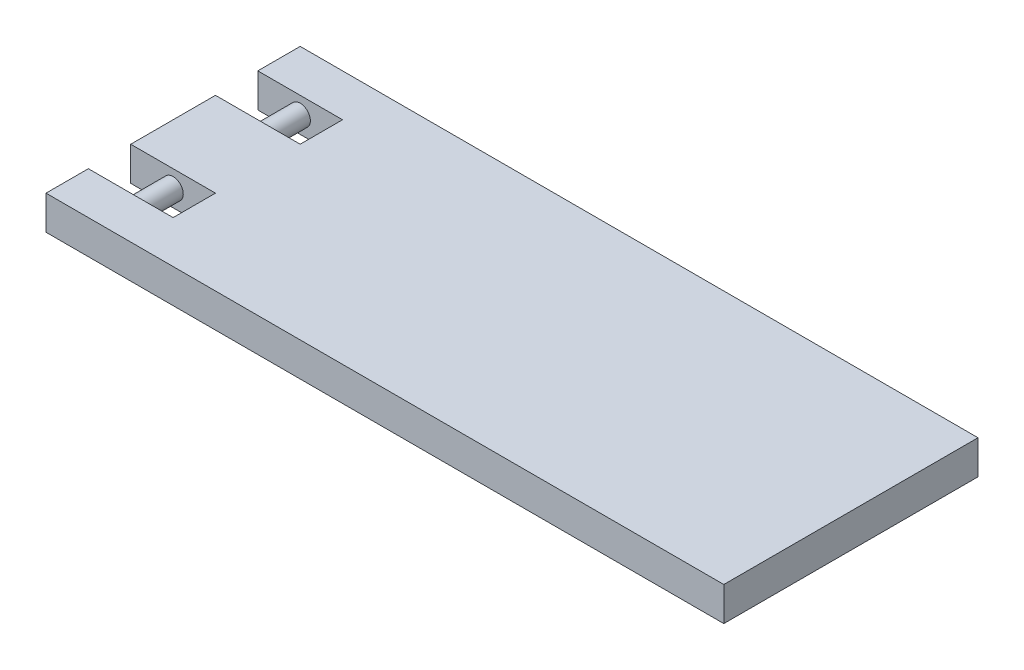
ISO-10303-21;
HEADER;
FILE_DESCRIPTION(('STEP AP214'),'2;1');
FILE_NAME('part.step','',(''),(''),'','','');
FILE_SCHEMA(('AUTOMOTIVE_DESIGN { 1 0 10303 214 1 1 1 1 }'));
ENDSEC;
DATA;
#1=APPLICATION_CONTEXT('core data for automotive mechanical design processes');
#2=APPLICATION_PROTOCOL_DEFINITION('international standard','automotive_design',2000,#1);
#3=PRODUCT_CONTEXT('',#1,'mechanical');
#4=PRODUCT('Part','Part','',(#3));
#5=PRODUCT_RELATED_PRODUCT_CATEGORY('part','',(#4));
#6=PRODUCT_DEFINITION_FORMATION('','',#4);
#7=PRODUCT_DEFINITION_CONTEXT('part definition',#1,'design');
#8=PRODUCT_DEFINITION('design','',#6,#7);
#9=PRODUCT_DEFINITION_SHAPE('','',#8);
#10=(LENGTH_UNIT() NAMED_UNIT(*) SI_UNIT(.MILLI.,.METRE.));
#11=(NAMED_UNIT(*) PLANE_ANGLE_UNIT() SI_UNIT($,.RADIAN.));
#12=(NAMED_UNIT(*) SI_UNIT($,.STERADIAN.) SOLID_ANGLE_UNIT());
#13=UNCERTAINTY_MEASURE_WITH_UNIT(LENGTH_MEASURE(1.E-05),#10,'distance_accuracy_value','');
#14=(GEOMETRIC_REPRESENTATION_CONTEXT(3) GLOBAL_UNCERTAINTY_ASSIGNED_CONTEXT((#13)) GLOBAL_UNIT_ASSIGNED_CONTEXT((#10,
#11,#12)) REPRESENTATION_CONTEXT('',''));
#15=CARTESIAN_POINT('',(0.,0.,0.));
#16=DIRECTION('',(0.,0.,1.));
#17=DIRECTION('',(1.,0.,0.));
#18=AXIS2_PLACEMENT_3D('',#15,#16,#17);
#19=CARTESIAN_POINT('',(0.,20.,-75.));
#20=DIRECTION('',(1.,0.,0.));
#21=DIRECTION('',(0.,0.,-1.));
#22=AXIS2_PLACEMENT_3D('',#19,#20,#21);
#23=PLANE('',#22);
#24=DIRECTION('',(0.,1.,0.));
#25=VECTOR('',#24,1.);
#26=CARTESIAN_POINT('',(0.,0.,25.));
#27=LINE('',#26,#25);
#28=CARTESIAN_POINT('',(0.,0.,25.));
#29=VERTEX_POINT('',#28);
#30=CARTESIAN_POINT('',(0.,20.,25.));
#31=VERTEX_POINT('',#30);
#32=EDGE_CURVE('E251',#29,#31,#27,.T.);
#33=ORIENTED_EDGE('',*,*,#32,.T.);
#34=DIRECTION('',(0.,0.,1.));
#35=VECTOR('',#34,1.);
#36=CARTESIAN_POINT('',(0.,20.,-75.));
#37=LINE('',#36,#35);
#38=CARTESIAN_POINT('',(0.,20.,-25.));
#39=VERTEX_POINT('',#38);
#40=EDGE_CURVE('E262',#39,#31,#37,.T.);
#41=ORIENTED_EDGE('',*,*,#40,.F.);
#42=DIRECTION('',(0.,1.,0.));
#43=VECTOR('',#42,1.);
#44=CARTESIAN_POINT('',(0.,0.,-25.));
#45=LINE('',#44,#43);
#46=CARTESIAN_POINT('',(0.,0.,-25.));
#47=VERTEX_POINT('',#46);
#48=EDGE_CURVE('E239',#47,#39,#45,.T.);
#49=ORIENTED_EDGE('',*,*,#48,.F.);
#50=DIRECTION('',(0.,0.,1.));
#51=VECTOR('',#50,1.);
#52=CARTESIAN_POINT('',(0.,0.,-75.));
#53=LINE('',#52,#51);
#54=EDGE_CURVE('E147',#47,#29,#53,.T.);
#55=ORIENTED_EDGE('',*,*,#54,.T.);
#56=EDGE_LOOP('',(#33,#41,#49,#55));
#57=FACE_BOUND('',#56,.T.);
#58=ADVANCED_FACE('F35',(#57),#23,.F.);
#59=DIRECTION('',(0.,1.,0.));
#60=VECTOR('',#59,1.);
#61=CARTESIAN_POINT('',(0.,0.,50.));
#62=LINE('',#61,#60);
#63=CARTESIAN_POINT('',(0.,0.,50.));
#64=VERTEX_POINT('',#63);
#65=CARTESIAN_POINT('',(0.,20.,50.));
#66=VERTEX_POINT('',#65);
#67=EDGE_CURVE('E125',#64,#66,#62,.T.);
#68=ORIENTED_EDGE('',*,*,#67,.F.);
#69=CARTESIAN_POINT('',(0.,0.,75.));
#70=VERTEX_POINT('',#69);
#71=EDGE_CURVE('E137',#64,#70,#53,.T.);
#72=ORIENTED_EDGE('',*,*,#71,.T.);
#73=DIRECTION('',(0.,-1.,0.));
#74=VECTOR('',#73,1.);
#75=CARTESIAN_POINT('',(0.,20.,75.));
#76=LINE('',#75,#74);
#77=CARTESIAN_POINT('',(0.,20.,75.));
#78=VERTEX_POINT('',#77);
#79=EDGE_CURVE('E176',#78,#70,#76,.T.);
#80=ORIENTED_EDGE('',*,*,#79,.F.);
#81=EDGE_CURVE('E139',#66,#78,#37,.T.);
#82=ORIENTED_EDGE('',*,*,#81,.F.);
#83=EDGE_LOOP('',(#68,#72,#80,#82));
#84=FACE_BOUND('',#83,.T.);
#85=ADVANCED_FACE('F135',(#84),#23,.F.);
#86=CARTESIAN_POINT('',(0.,20.,75.));
#87=DIRECTION('',(0.,1.,0.));
#88=DIRECTION('',(0.,0.,1.));
#89=AXIS2_PLACEMENT_3D('',#86,#87,#88);
#90=PLANE('',#89);
#91=ORIENTED_EDGE('',*,*,#40,.T.);
#92=DIRECTION('',(1.,0.,0.));
#93=VECTOR('',#92,1.);
#94=CARTESIAN_POINT('',(0.,20.,25.));
#95=LINE('',#94,#93);
#96=CARTESIAN_POINT('',(50.,20.,25.));
#97=VERTEX_POINT('',#96);
#98=EDGE_CURVE('E131',#31,#97,#95,.T.);
#99=ORIENTED_EDGE('',*,*,#98,.T.);
#100=DIRECTION('',(0.,0.,1.));
#101=VECTOR('',#100,1.);
#102=CARTESIAN_POINT('',(50.,20.,50.));
#103=LINE('',#102,#101);
#104=CARTESIAN_POINT('',(50.,20.,50.));
#105=VERTEX_POINT('',#104);
#106=EDGE_CURVE('E283',#97,#105,#103,.T.);
#107=ORIENTED_EDGE('',*,*,#106,.T.);
#108=DIRECTION('',(-1.,0.,0.));
#109=VECTOR('',#108,1.);
#110=CARTESIAN_POINT('',(0.,20.,50.));
#111=LINE('',#110,#109);
#112=EDGE_CURVE('E281',#105,#66,#111,.T.);
#113=ORIENTED_EDGE('',*,*,#112,.T.);
#114=ORIENTED_EDGE('',*,*,#81,.T.);
#115=DIRECTION('',(1.,0.,0.));
#116=VECTOR('',#115,1.);
#117=CARTESIAN_POINT('',(0.,20.,75.));
#118=LINE('',#117,#116);
#119=CARTESIAN_POINT('',(400.,20.,75.));
#120=VERTEX_POINT('',#119);
#121=EDGE_CURVE('E261',#78,#120,#118,.T.);
#122=ORIENTED_EDGE('',*,*,#121,.T.);
#123=DIRECTION('',(0.,0.,-1.));
#124=VECTOR('',#123,1.);
#125=CARTESIAN_POINT('',(400.,20.,-75.));
#126=LINE('',#125,#124);
#127=CARTESIAN_POINT('',(400.,20.,-75.));
#128=VERTEX_POINT('',#127);
#129=EDGE_CURVE('E264',#120,#128,#126,.T.);
#130=ORIENTED_EDGE('',*,*,#129,.T.);
#131=DIRECTION('',(-1.,0.,0.));
#132=VECTOR('',#131,1.);
#133=CARTESIAN_POINT('',(0.,20.,-75.));
#134=LINE('',#133,#132);
#135=CARTESIAN_POINT('',(0.,20.,-75.));
#136=VERTEX_POINT('',#135);
#137=EDGE_CURVE('E172',#128,#136,#134,.T.);
#138=ORIENTED_EDGE('',*,*,#137,.T.);
#139=CARTESIAN_POINT('',(0.,20.,-50.));
#140=VERTEX_POINT('',#139);
#141=EDGE_CURVE('E258',#136,#140,#37,.T.);
#142=ORIENTED_EDGE('',*,*,#141,.T.);
#143=DIRECTION('',(-1.,0.,0.));
#144=VECTOR('',#143,1.);
#145=CARTESIAN_POINT('',(0.,20.,-50.));
#146=LINE('',#145,#144);
#147=CARTESIAN_POINT('',(50.,20.,-50.));
#148=VERTEX_POINT('',#147);
#149=EDGE_CURVE('E254',#148,#140,#146,.T.);
#150=ORIENTED_EDGE('',*,*,#149,.F.);
#151=DIRECTION('',(0.,0.,-1.));
#152=VECTOR('',#151,1.);
#153=CARTESIAN_POINT('',(50.,20.,-50.));
#154=LINE('',#153,#152);
#155=CARTESIAN_POINT('',(50.,20.,-25.));
#156=VERTEX_POINT('',#155);
#157=EDGE_CURVE('E250',#156,#148,#154,.T.);
#158=ORIENTED_EDGE('',*,*,#157,.F.);
#159=DIRECTION('',(1.,0.,0.));
#160=VECTOR('',#159,1.);
#161=CARTESIAN_POINT('',(0.,20.,-25.));
#162=LINE('',#161,#160);
#163=EDGE_CURVE('E247',#39,#156,#162,.T.);
#164=ORIENTED_EDGE('',*,*,#163,.F.);
#165=EDGE_LOOP('',(#91,#99,#107,#113,#114,#122,#130,#138,#142,#150,#158,#164));
#166=FACE_BOUND('',#165,.T.);
#167=ADVANCED_FACE('F203',(#166),#90,.T.);
#168=CARTESIAN_POINT('',(0.,0.,75.));
#169=DIRECTION('',(0.,1.,0.));
#170=DIRECTION('',(0.,0.,1.));
#171=AXIS2_PLACEMENT_3D('',#168,#169,#170);
#172=PLANE('',#171);
#173=DIRECTION('',(1.,0.,0.));
#174=VECTOR('',#173,1.);
#175=CARTESIAN_POINT('',(0.,0.,25.));
#176=LINE('',#175,#174);
#177=CARTESIAN_POINT('',(50.,0.,25.));
#178=VERTEX_POINT('',#177);
#179=EDGE_CURVE('E140',#29,#178,#176,.T.);
#180=ORIENTED_EDGE('',*,*,#179,.F.);
#181=ORIENTED_EDGE('',*,*,#54,.F.);
#182=DIRECTION('',(1.,0.,0.));
#183=VECTOR('',#182,1.);
#184=CARTESIAN_POINT('',(0.,0.,-25.));
#185=LINE('',#184,#183);
#186=CARTESIAN_POINT('',(50.,0.,-25.));
#187=VERTEX_POINT('',#186);
#188=EDGE_CURVE('E243',#47,#187,#185,.T.);
#189=ORIENTED_EDGE('',*,*,#188,.T.);
#190=DIRECTION('',(0.,0.,-1.));
#191=VECTOR('',#190,1.);
#192=CARTESIAN_POINT('',(50.,0.,-50.));
#193=LINE('',#192,#191);
#194=CARTESIAN_POINT('',(50.,0.,-50.));
#195=VERTEX_POINT('',#194);
#196=EDGE_CURVE('E58',#187,#195,#193,.T.);
#197=ORIENTED_EDGE('',*,*,#196,.T.);
#198=DIRECTION('',(-1.,0.,0.));
#199=VECTOR('',#198,1.);
#200=CARTESIAN_POINT('',(0.,0.,-50.));
#201=LINE('',#200,#199);
#202=CARTESIAN_POINT('',(0.,0.,-50.));
#203=VERTEX_POINT('',#202);
#204=EDGE_CURVE('E236',#195,#203,#201,.T.);
#205=ORIENTED_EDGE('',*,*,#204,.T.);
#206=CARTESIAN_POINT('',(0.,0.,-75.));
#207=VERTEX_POINT('',#206);
#208=EDGE_CURVE('E150',#207,#203,#53,.T.);
#209=ORIENTED_EDGE('',*,*,#208,.F.);
#210=DIRECTION('',(-1.,0.,0.));
#211=VECTOR('',#210,1.);
#212=CARTESIAN_POINT('',(0.,0.,-75.));
#213=LINE('',#212,#211);
#214=CARTESIAN_POINT('',(400.,0.,-75.));
#215=VERTEX_POINT('',#214);
#216=EDGE_CURVE('E165',#215,#207,#213,.T.);
#217=ORIENTED_EDGE('',*,*,#216,.F.);
#218=DIRECTION('',(0.,0.,-1.));
#219=VECTOR('',#218,1.);
#220=CARTESIAN_POINT('',(400.,0.,-75.));
#221=LINE('',#220,#219);
#222=CARTESIAN_POINT('',(400.,0.,75.));
#223=VERTEX_POINT('',#222);
#224=EDGE_CURVE('E161',#223,#215,#221,.T.);
#225=ORIENTED_EDGE('',*,*,#224,.F.);
#226=DIRECTION('',(1.,0.,0.));
#227=VECTOR('',#226,1.);
#228=CARTESIAN_POINT('',(0.,0.,75.));
#229=LINE('',#228,#227);
#230=EDGE_CURVE('E145',#70,#223,#229,.T.);
#231=ORIENTED_EDGE('',*,*,#230,.F.);
#232=ORIENTED_EDGE('',*,*,#71,.F.);
#233=DIRECTION('',(-1.,0.,0.));
#234=VECTOR('',#233,1.);
#235=CARTESIAN_POINT('',(0.,0.,50.));
#236=LINE('',#235,#234);
#237=CARTESIAN_POINT('',(50.,0.,50.));
#238=VERTEX_POINT('',#237);
#239=EDGE_CURVE('E122',#238,#64,#236,.T.);
#240=ORIENTED_EDGE('',*,*,#239,.F.);
#241=DIRECTION('',(0.,0.,1.));
#242=VECTOR('',#241,1.);
#243=CARTESIAN_POINT('',(50.,0.,50.));
#244=LINE('',#243,#242);
#245=EDGE_CURVE('E130',#178,#238,#244,.T.);
#246=ORIENTED_EDGE('',*,*,#245,.F.);
#247=EDGE_LOOP('',(#180,#181,#189,#197,#205,#209,#217,#225,#231,#232,#240,#246));
#248=FACE_BOUND('',#247,.T.);
#249=ADVANCED_FACE('F143',(#248),#172,.F.);
#250=ORIENTED_EDGE('',*,*,#208,.T.);
#251=DIRECTION('',(0.,1.,0.));
#252=VECTOR('',#251,1.);
#253=CARTESIAN_POINT('',(0.,0.,-50.));
#254=LINE('',#253,#252);
#255=EDGE_CURVE('E148',#203,#140,#254,.T.);
#256=ORIENTED_EDGE('',*,*,#255,.T.);
#257=ORIENTED_EDGE('',*,*,#141,.F.);
#258=DIRECTION('',(0.,-1.,0.));
#259=VECTOR('',#258,1.);
#260=CARTESIAN_POINT('',(0.,20.,-75.));
#261=LINE('',#260,#259);
#262=EDGE_CURVE('E169',#136,#207,#261,.T.);
#263=ORIENTED_EDGE('',*,*,#262,.T.);
#264=EDGE_LOOP('',(#250,#256,#257,#263));
#265=FACE_BOUND('',#264,.T.);
#266=ADVANCED_FACE('F199',(#265),#23,.F.);
#267=CARTESIAN_POINT('',(0.,20.,75.));
#268=DIRECTION('',(0.,0.,-1.));
#269=DIRECTION('',(-1.,0.,0.));
#270=AXIS2_PLACEMENT_3D('',#267,#268,#269);
#271=PLANE('',#270);
#272=ORIENTED_EDGE('',*,*,#230,.T.);
#273=DIRECTION('',(0.,-1.,0.));
#274=VECTOR('',#273,1.);
#275=CARTESIAN_POINT('',(400.,20.,75.));
#276=LINE('',#275,#274);
#277=EDGE_CURVE('E175',#120,#223,#276,.T.);
#278=ORIENTED_EDGE('',*,*,#277,.F.);
#279=ORIENTED_EDGE('',*,*,#121,.F.);
#280=ORIENTED_EDGE('',*,*,#79,.T.);
#281=EDGE_LOOP('',(#272,#278,#279,#280));
#282=FACE_BOUND('',#281,.T.);
#283=ADVANCED_FACE('F206',(#282),#271,.F.);
#284=CARTESIAN_POINT('',(400.,20.,-75.));
#285=DIRECTION('',(-1.,0.,0.));
#286=DIRECTION('',(0.,0.,1.));
#287=AXIS2_PLACEMENT_3D('',#284,#285,#286);
#288=PLANE('',#287);
#289=ORIENTED_EDGE('',*,*,#224,.T.);
#290=DIRECTION('',(0.,-1.,0.));
#291=VECTOR('',#290,1.);
#292=CARTESIAN_POINT('',(400.,20.,-75.));
#293=LINE('',#292,#291);
#294=EDGE_CURVE('E171',#128,#215,#293,.T.);
#295=ORIENTED_EDGE('',*,*,#294,.F.);
#296=ORIENTED_EDGE('',*,*,#129,.F.);
#297=ORIENTED_EDGE('',*,*,#277,.T.);
#298=EDGE_LOOP('',(#289,#295,#296,#297));
#299=FACE_BOUND('',#298,.T.);
#300=ADVANCED_FACE('F211',(#299),#288,.F.);
#301=CARTESIAN_POINT('',(0.,20.,-75.));
#302=DIRECTION('',(0.,0.,1.));
#303=DIRECTION('',(1.,0.,0.));
#304=AXIS2_PLACEMENT_3D('',#301,#302,#303);
#305=PLANE('',#304);
#306=ORIENTED_EDGE('',*,*,#216,.T.);
#307=ORIENTED_EDGE('',*,*,#262,.F.);
#308=ORIENTED_EDGE('',*,*,#137,.F.);
#309=ORIENTED_EDGE('',*,*,#294,.T.);
#310=EDGE_LOOP('',(#306,#307,#308,#309));
#311=FACE_BOUND('',#310,.T.);
#312=ADVANCED_FACE('F220',(#311),#305,.F.);
#313=CARTESIAN_POINT('',(0.,0.,-50.));
#314=DIRECTION('',(0.,0.,-1.));
#315=DIRECTION('',(-1.,0.,0.));
#316=AXIS2_PLACEMENT_3D('',#313,#314,#315);
#317=PLANE('',#316);
#318=CARTESIAN_POINT('',(25.,10.,-50.));
#319=DIRECTION('',(0.,0.,-1.));
#320=DIRECTION('',(-1.,0.,0.));
#321=AXIS2_PLACEMENT_3D('',#318,#319,#320);
#322=CIRCLE('',#321,6.);
#323=CARTESIAN_POINT('',(19.,10.,-50.));
#324=VERTEX_POINT('',#323);
#325=EDGE_CURVE('E284',#324,#324,#322,.T.);
#326=ORIENTED_EDGE('',*,*,#325,.T.);
#327=EDGE_LOOP('',(#326));
#328=FACE_BOUND('',#327,.T.);
#329=ORIENTED_EDGE('',*,*,#149,.T.);
#330=ORIENTED_EDGE('',*,*,#255,.F.);
#331=ORIENTED_EDGE('',*,*,#204,.F.);
#332=DIRECTION('',(0.,1.,0.));
#333=VECTOR('',#332,1.);
#334=CARTESIAN_POINT('',(50.,0.,-50.));
#335=LINE('',#334,#333);
#336=EDGE_CURVE('E153',#195,#148,#335,.T.);
#337=ORIENTED_EDGE('',*,*,#336,.T.);
#338=EDGE_LOOP('',(#329,#330,#331,#337));
#339=FACE_BOUND('',#338,.T.);
#340=ADVANCED_FACE('F223',(#328,#339),#317,.F.);
#341=CARTESIAN_POINT('',(50.,0.,-50.));
#342=DIRECTION('',(1.,0.,0.));
#343=DIRECTION('',(0.,0.,-1.));
#344=AXIS2_PLACEMENT_3D('',#341,#342,#343);
#345=PLANE('',#344);
#346=ORIENTED_EDGE('',*,*,#157,.T.);
#347=ORIENTED_EDGE('',*,*,#336,.F.);
#348=ORIENTED_EDGE('',*,*,#196,.F.);
#349=DIRECTION('',(0.,1.,0.));
#350=VECTOR('',#349,1.);
#351=CARTESIAN_POINT('',(50.,0.,-25.));
#352=LINE('',#351,#350);
#353=EDGE_CURVE('E241',#187,#156,#352,.T.);
#354=ORIENTED_EDGE('',*,*,#353,.T.);
#355=EDGE_LOOP('',(#346,#347,#348,#354));
#356=FACE_BOUND('',#355,.T.);
#357=ADVANCED_FACE('F271',(#356),#345,.F.);
#358=CARTESIAN_POINT('',(0.,0.,-25.));
#359=DIRECTION('',(0.,0.,1.));
#360=DIRECTION('',(1.,0.,0.));
#361=AXIS2_PLACEMENT_3D('',#358,#359,#360);
#362=PLANE('',#361);
#363=CARTESIAN_POINT('',(25.,10.,-25.));
#364=DIRECTION('',(0.,0.,1.));
#365=DIRECTION('',(1.,0.,0.));
#366=AXIS2_PLACEMENT_3D('',#363,#364,#365);
#367=CIRCLE('',#366,6.);
#368=CARTESIAN_POINT('',(31.,10.,-25.));
#369=VERTEX_POINT('',#368);
#370=EDGE_CURVE('E313',#369,#369,#367,.T.);
#371=ORIENTED_EDGE('',*,*,#370,.T.);
#372=EDGE_LOOP('',(#371));
#373=FACE_BOUND('',#372,.T.);
#374=ORIENTED_EDGE('',*,*,#163,.T.);
#375=ORIENTED_EDGE('',*,*,#353,.F.);
#376=ORIENTED_EDGE('',*,*,#188,.F.);
#377=ORIENTED_EDGE('',*,*,#48,.T.);
#378=EDGE_LOOP('',(#374,#375,#376,#377));
#379=FACE_BOUND('',#378,.T.);
#380=ADVANCED_FACE('F273',(#373,#379),#362,.F.);
#381=CARTESIAN_POINT('',(0.,0.,25.));
#382=DIRECTION('',(0.,0.,1.));
#383=DIRECTION('',(1.,0.,0.));
#384=AXIS2_PLACEMENT_3D('',#381,#382,#383);
#385=PLANE('',#384);
#386=CARTESIAN_POINT('',(25.,10.,25.));
#387=DIRECTION('',(0.,0.,1.));
#388=DIRECTION('',(1.,0.,0.));
#389=AXIS2_PLACEMENT_3D('',#386,#387,#388);
#390=CIRCLE('',#389,6.);
#391=CARTESIAN_POINT('',(31.,10.,25.));
#392=VERTEX_POINT('',#391);
#393=EDGE_CURVE('E11',#392,#392,#390,.T.);
#394=ORIENTED_EDGE('',*,*,#393,.F.);
#395=EDGE_LOOP('',(#394));
#396=FACE_BOUND('',#395,.T.);
#397=ORIENTED_EDGE('',*,*,#98,.F.);
#398=ORIENTED_EDGE('',*,*,#32,.F.);
#399=ORIENTED_EDGE('',*,*,#179,.T.);
#400=DIRECTION('',(0.,1.,0.));
#401=VECTOR('',#400,1.);
#402=CARTESIAN_POINT('',(50.,0.,25.));
#403=LINE('',#402,#401);
#404=EDGE_CURVE('E290',#178,#97,#403,.T.);
#405=ORIENTED_EDGE('',*,*,#404,.T.);
#406=EDGE_LOOP('',(#397,#398,#399,#405));
#407=FACE_BOUND('',#406,.T.);
#408=ADVANCED_FACE('F193',(#396,#407),#385,.T.);
#409=CARTESIAN_POINT('',(50.,0.,50.));
#410=DIRECTION('',(-1.,0.,0.));
#411=DIRECTION('',(0.,0.,1.));
#412=AXIS2_PLACEMENT_3D('',#409,#410,#411);
#413=PLANE('',#412);
#414=ORIENTED_EDGE('',*,*,#106,.F.);
#415=ORIENTED_EDGE('',*,*,#404,.F.);
#416=ORIENTED_EDGE('',*,*,#245,.T.);
#417=DIRECTION('',(0.,1.,0.));
#418=VECTOR('',#417,1.);
#419=CARTESIAN_POINT('',(50.,0.,50.));
#420=LINE('',#419,#418);
#421=EDGE_CURVE('E50',#238,#105,#420,.T.);
#422=ORIENTED_EDGE('',*,*,#421,.T.);
#423=EDGE_LOOP('',(#414,#415,#416,#422));
#424=FACE_BOUND('',#423,.T.);
#425=ADVANCED_FACE('F184',(#424),#413,.T.);
#426=CARTESIAN_POINT('',(0.,0.,50.));
#427=DIRECTION('',(0.,0.,-1.));
#428=DIRECTION('',(-1.,0.,0.));
#429=AXIS2_PLACEMENT_3D('',#426,#427,#428);
#430=PLANE('',#429);
#431=CARTESIAN_POINT('',(25.,10.,50.));
#432=DIRECTION('',(0.,0.,-1.));
#433=DIRECTION('',(-1.,0.,0.));
#434=AXIS2_PLACEMENT_3D('',#431,#432,#433);
#435=CIRCLE('',#434,6.);
#436=CARTESIAN_POINT('',(19.,10.,50.));
#437=VERTEX_POINT('',#436);
#438=EDGE_CURVE('E38',#437,#437,#435,.T.);
#439=ORIENTED_EDGE('',*,*,#438,.F.);
#440=EDGE_LOOP('',(#439));
#441=FACE_BOUND('',#440,.T.);
#442=ORIENTED_EDGE('',*,*,#112,.F.);
#443=ORIENTED_EDGE('',*,*,#421,.F.);
#444=ORIENTED_EDGE('',*,*,#239,.T.);
#445=ORIENTED_EDGE('',*,*,#67,.T.);
#446=EDGE_LOOP('',(#442,#443,#444,#445));
#447=FACE_BOUND('',#446,.T.);
#448=ADVANCED_FACE('F124',(#441,#447),#430,.T.);
#449=CARTESIAN_POINT('',(25.,10.,-91.9705627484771));
#450=DIRECTION('',(0.,0.,1.));
#451=DIRECTION('',(1.,0.,0.));
#452=AXIS2_PLACEMENT_3D('',#449,#450,#451);
#453=CYLINDRICAL_SURFACE('',#452,6.);
#454=ORIENTED_EDGE('',*,*,#393,.T.);
#455=EDGE_LOOP('',(#454));
#456=FACE_BOUND('',#455,.T.);
#457=ORIENTED_EDGE('',*,*,#438,.T.);
#458=EDGE_LOOP('',(#457));
#459=FACE_BOUND('',#458,.T.);
#460=ADVANCED_FACE('F181',(#456,#459),#453,.T.);
#461=ORIENTED_EDGE('',*,*,#370,.F.);
#462=EDGE_LOOP('',(#461));
#463=FACE_BOUND('',#462,.T.);
#464=ORIENTED_EDGE('',*,*,#325,.F.);
#465=EDGE_LOOP('',(#464));
#466=FACE_BOUND('',#465,.T.);
#467=ADVANCED_FACE('F190',(#463,#466),#453,.T.);
#468=CLOSED_SHELL('',(#58,#85,#167,#249,#266,#283,#300,#312,#340,#357,#380,#408,#425,#448,#460,#467));
#469=MANIFOLD_SOLID_BREP('B2',#468);
#470=ADVANCED_BREP_SHAPE_REPRESENTATION('',(#18,#469),#14);
#471=SHAPE_DEFINITION_REPRESENTATION(#9,#470);
ENDSEC;
END-ISO-10303-21;
